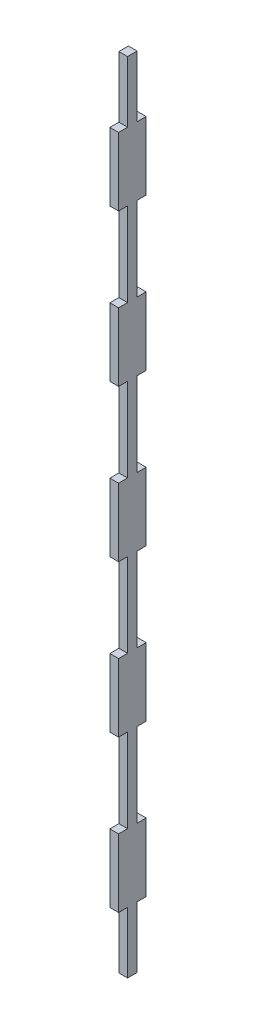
from build123d import *

# Parameters (mm, degrees)
BOSS_EXTRU_1_DEPTH = 2.9


with BuildPart() as part:
    # Esquisse1 → Boss.-Extru.1 (new body)
    with BuildSketch(Plane.ZY.offset(123.5)):
        Polygon((0, -108.6), (3, -108.6), (3, -85.9), (0, -85.9), (0, -57.975), (3, -57.975), (3, -35.275), (0, -35.275), (0, -7.35), (3, -7.35), (3, 15.35), (0, 15.35), (0, 43.275), (3, 43.275), (3, 65.975), (0, 65.975), (0, 93.9), (3, 93.9), (3, 116.6), (0, 116.6), (0, 137), (-3.2, 137), (-3.2, 116.6), (-6.2, 116.6), (-6.2, 93.9), (-3.2, 93.9), (-3.2, 65.975), (-6.2, 65.975), (-6.2, 43.275), (-3.2, 43.275), (-3.2, 15.35), (-6.2, 15.35), (-6.2, -7.35), (-3.2, -7.35), (-3.2, -35.275), (-6.2, -35.275), (-6.2, -57.975), (-3.2, -57.975), (-3.2, -85.9), (-6.2, -85.9), (-6.2, -108.6), (-3.2, -108.6), (-3.2, -129), (0, -129), align=None)
    extrude(amount=BOSS_EXTRU_1_DEPTH)


solid = part.part
